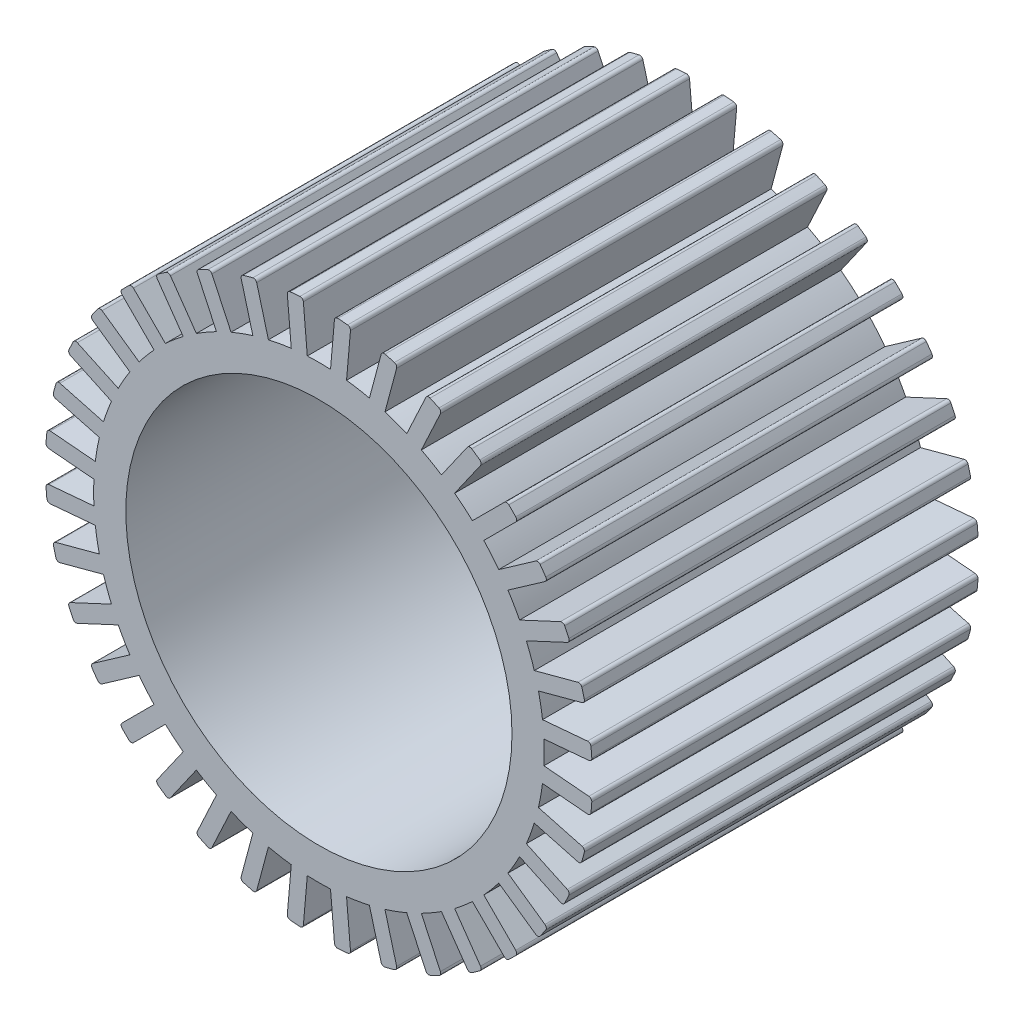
from build123d import *

# Parameters (mm, degrees)
ESQUISSE1_R                        = 8.5
ESQUISSE1_R_2                      = 6
EXTRUSION1_DEPTH                   = 12
ENL_V_MAT_EXTRU_1_DEPTH            = 17.985287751
CONG_1_R                           = 0.1
R_P_TITION_CIRCULAIRE1_COUNT       = 36
CONG_1_OF_R_P_TITION_CIRCULAIRE1_R = 0.1


with BuildPart() as part:
    # Esquisse1 → Extrusion1 (new body)
    with BuildSketch(Plane.XY):
        Circle(ESQUISSE1_R)
        Circle(ESQUISSE1_R_2, mode=Mode.SUBTRACT)
    extrude(amount=EXTRUSION1_DEPTH)

    # Esquisse2 → Enl_v. mat.-Extru.1 (cut, through all)
    with BuildSketch(Plane.XY.offset(12)):
        with BuildLine():
            Line((-0.600555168, 9.732805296), (-0.360652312, 6.990703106))
            ThreePointArc((-0.360652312, 6.990703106), (0, 7), (0.360652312, 6.990703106))
            Line((0.360652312, 6.990703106), (0.600555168, 9.732805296))
            Line((0.600555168, 9.732805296), (-0.600555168, 9.732805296))
        make_face()
    enl_v_mat_extru_1 = extrude(amount=-ENL_V_MAT_EXTRU_1_DEPTH, mode=Mode.SUBTRACT)

    # Cong_1
    cong_1_edges = [part.edges().sort_by_distance(p)[0] for p in [
        (-0.491454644, 8.485780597, 6),
        (0.491454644, 8.485780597, 6),
    ]]
    fillet(cong_1_edges, radius=CONG_1_R)

    # R_p_tition circulaire1: Enl_v. mat.-Extru.1 ×36 about axis
    r_p_tition_circulaire1_axis = Axis((0, 0, 0), (0, 0, 1))
    for i in range(1, R_P_TITION_CIRCULAIRE1_COUNT):
        add(enl_v_mat_extru_1.rotate(r_p_tition_circulaire1_axis, i * 360 / R_P_TITION_CIRCULAIRE1_COUNT), mode=Mode.SUBTRACT)

    # Cong_1 of R_p_tition circulaire1
    cong_1_of_r_p_tition_circulaire1_edges = [part.edges().sort_by_distance(p)[0] for p in [
        (-1.95752868, 8.271522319, 6),
        (-0.989551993, 8.442202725, 6),
        (-3.364124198, 7.80593802, 6),
        (-2.440491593, 8.142112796, 6),
        (-4.668502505, 7.103174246, 6),
        (-3.817278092, 7.59462889, 6),
        (-5.831030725, 6.184584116, 6),
        (-5.078078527, 6.816386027, 6),
        (-6.816386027, 5.078078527, 6),
        (-6.184584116, 5.831030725, 6),
        (-7.59462889, 3.817278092, 6),
        (-7.103174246, 4.668502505, 6),
        (-8.142112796, 2.440491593, 6),
        (-7.80593802, 3.364124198, 6),
        (-8.442202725, 0.989551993, 6),
        (-8.271522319, 1.95752868, 6),
        (-8.485780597, -0.491454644, 6),
        (-8.485780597, 0.491454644, 6),
        (-8.271522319, -1.95752868, 6),
        (-8.442202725, -0.989551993, 6),
        (-7.80593802, -3.364124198, 6),
        (-8.142112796, -2.440491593, 6),
        (-7.103174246, -4.668502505, 6),
        (-7.59462889, -3.817278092, 6),
        (-6.184584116, -5.831030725, 6),
        (-6.816386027, -5.078078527, 6),
        (-5.078078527, -6.816386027, 6),
        (-5.831030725, -6.184584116, 6),
        (-3.817278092, -7.59462889, 6),
        (-4.668502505, -7.103174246, 6),
        (-2.440491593, -8.142112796, 6),
        (-3.364124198, -7.80593802, 6),
        (-0.989551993, -8.442202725, 6),
        (-1.95752868, -8.271522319, 6),
        (0.491454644, -8.485780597, 6),
        (-0.491454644, -8.485780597, 6),
        (1.95752868, -8.271522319, 6),
        (0.989551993, -8.442202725, 6),
        (3.364124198, -7.80593802, 6),
        (2.440491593, -8.142112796, 6),
        (4.668502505, -7.103174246, 6),
        (3.817278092, -7.59462889, 6),
        (5.831030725, -6.184584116, 6),
        (5.078078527, -6.816386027, 6),
        (6.816386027, -5.078078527, 6),
        (6.184584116, -5.831030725, 6),
        (7.59462889, -3.817278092, 6),
        (7.103174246, -4.668502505, 6),
        (8.142112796, -2.440491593, 6),
        (7.80593802, -3.364124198, 6),
        (8.442202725, -0.989551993, 6),
        (8.271522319, -1.95752868, 6),
        (8.485780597, 0.491454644, 6),
        (8.485780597, -0.491454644, 6),
        (8.271522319, 1.95752868, 6),
        (8.442202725, 0.989551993, 6),
        (7.80593802, 3.364124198, 6),
        (8.142112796, 2.440491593, 6),
        (7.103174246, 4.668502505, 6),
        (7.59462889, 3.817278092, 6),
        (6.184584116, 5.831030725, 6),
        (6.816386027, 5.078078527, 6),
        (5.078078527, 6.816386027, 6),
        (5.831030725, 6.184584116, 6),
        (3.817278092, 7.59462889, 6),
        (4.668502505, 7.103174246, 6),
        (2.440491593, 8.142112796, 6),
        (3.364124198, 7.80593802, 6),
        (0.989551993, 8.442202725, 6),
        (1.95752868, 8.271522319, 6),
    ]]
    fillet(cong_1_of_r_p_tition_circulaire1_edges, radius=CONG_1_OF_R_P_TITION_CIRCULAIRE1_R)


solid = part.part
